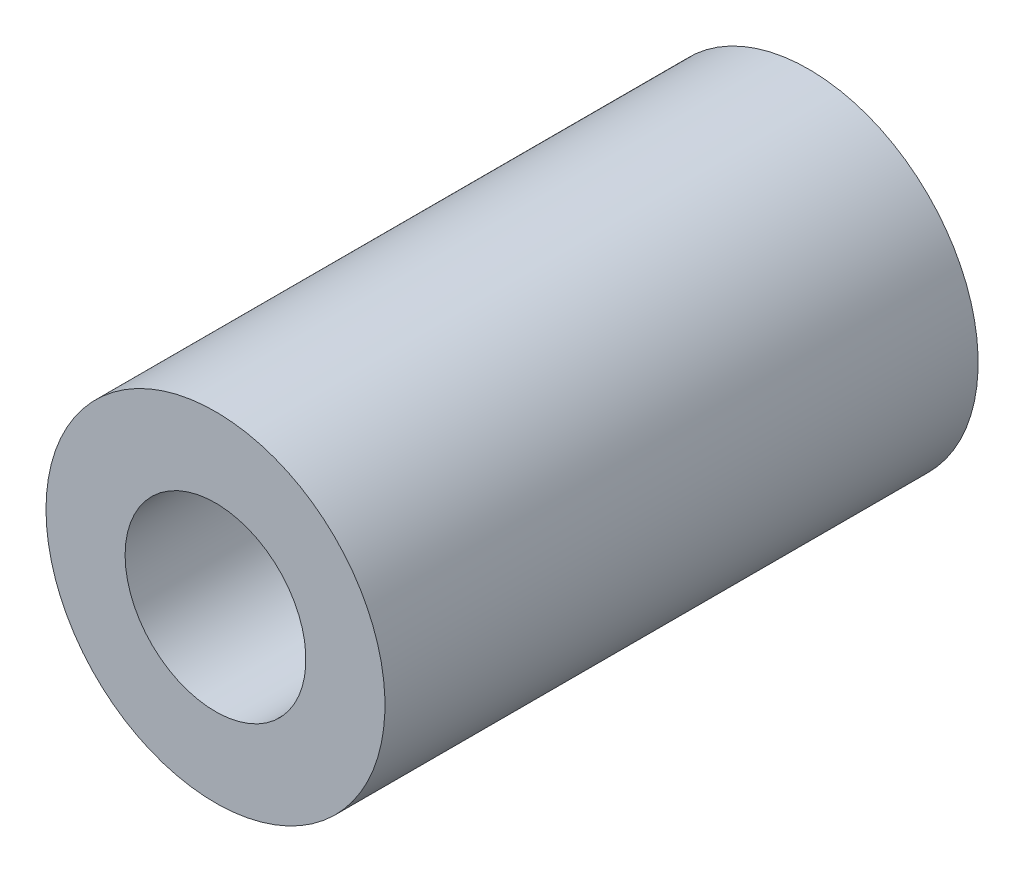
ISO-10303-21;
HEADER;
FILE_DESCRIPTION(('STEP AP214'),'2;1');
FILE_NAME('part.step','',(''),(''),'','','');
FILE_SCHEMA(('AUTOMOTIVE_DESIGN { 1 0 10303 214 1 1 1 1 }'));
ENDSEC;
DATA;
#1=APPLICATION_CONTEXT('core data for automotive mechanical design processes');
#2=APPLICATION_PROTOCOL_DEFINITION('international standard','automotive_design',2000,#1);
#3=PRODUCT_CONTEXT('',#1,'mechanical');
#4=PRODUCT('Part','Part','',(#3));
#5=PRODUCT_RELATED_PRODUCT_CATEGORY('part','',(#4));
#6=PRODUCT_DEFINITION_FORMATION('','',#4);
#7=PRODUCT_DEFINITION_CONTEXT('part definition',#1,'design');
#8=PRODUCT_DEFINITION('design','',#6,#7);
#9=PRODUCT_DEFINITION_SHAPE('','',#8);
#10=(LENGTH_UNIT() NAMED_UNIT(*) SI_UNIT(.MILLI.,.METRE.));
#11=(NAMED_UNIT(*) PLANE_ANGLE_UNIT() SI_UNIT($,.RADIAN.));
#12=(NAMED_UNIT(*) SI_UNIT($,.STERADIAN.) SOLID_ANGLE_UNIT());
#13=UNCERTAINTY_MEASURE_WITH_UNIT(LENGTH_MEASURE(1.E-05),#10,'distance_accuracy_value','');
#14=(GEOMETRIC_REPRESENTATION_CONTEXT(3) GLOBAL_UNCERTAINTY_ASSIGNED_CONTEXT((#13)) GLOBAL_UNIT_ASSIGNED_CONTEXT((#10,
#11,#12)) REPRESENTATION_CONTEXT('',''));
#15=CARTESIAN_POINT('',(0.,0.,0.));
#16=DIRECTION('',(0.,0.,1.));
#17=DIRECTION('',(1.,0.,0.));
#18=AXIS2_PLACEMENT_3D('',#15,#16,#17);
#19=CARTESIAN_POINT('',(0.,0.,10.5));
#20=DIRECTION('',(0.,0.,1.));
#21=DIRECTION('',(1.,0.,0.));
#22=AXIS2_PLACEMENT_3D('',#19,#20,#21);
#23=PLANE('',#22);
#24=CARTESIAN_POINT('',(0.,0.,10.5));
#25=DIRECTION('',(0.,0.,1.));
#26=DIRECTION('',(1.,0.,0.));
#27=AXIS2_PLACEMENT_3D('',#24,#25,#26);
#28=CIRCLE('',#27,3.);
#29=CARTESIAN_POINT('',(-3.,0.,10.5));
#30=VERTEX_POINT('',#29);
#31=EDGE_CURVE('E10',#30,#30,#28,.T.);
#32=ORIENTED_EDGE('',*,*,#31,.T.);
#33=EDGE_LOOP('',(#32));
#34=FACE_BOUND('',#33,.T.);
#35=CARTESIAN_POINT('',(0.,0.,10.5));
#36=DIRECTION('',(0.,0.,1.));
#37=DIRECTION('',(1.,0.,0.));
#38=AXIS2_PLACEMENT_3D('',#35,#36,#37);
#39=CIRCLE('',#38,1.6);
#40=CARTESIAN_POINT('',(-1.6,0.,10.5));
#41=VERTEX_POINT('',#40);
#42=EDGE_CURVE('E41',#41,#41,#39,.T.);
#43=ORIENTED_EDGE('',*,*,#42,.F.);
#44=EDGE_LOOP('',(#43));
#45=FACE_BOUND('',#44,.T.);
#46=ADVANCED_FACE('F30',(#34,#45),#23,.T.);
#47=CARTESIAN_POINT('',(0.,0.,0.));
#48=DIRECTION('',(0.,0.,1.));
#49=DIRECTION('',(1.,0.,0.));
#50=AXIS2_PLACEMENT_3D('',#47,#48,#49);
#51=PLANE('',#50);
#52=CARTESIAN_POINT('',(0.,0.,0.));
#53=DIRECTION('',(0.,0.,1.));
#54=DIRECTION('',(1.,0.,0.));
#55=AXIS2_PLACEMENT_3D('',#52,#53,#54);
#56=CIRCLE('',#55,3.);
#57=CARTESIAN_POINT('',(-3.,0.,0.));
#58=VERTEX_POINT('',#57);
#59=EDGE_CURVE('E34',#58,#58,#56,.T.);
#60=ORIENTED_EDGE('',*,*,#59,.F.);
#61=EDGE_LOOP('',(#60));
#62=FACE_BOUND('',#61,.T.);
#63=CARTESIAN_POINT('',(0.,0.,0.));
#64=DIRECTION('',(0.,0.,1.));
#65=DIRECTION('',(1.,0.,0.));
#66=AXIS2_PLACEMENT_3D('',#63,#64,#65);
#67=CIRCLE('',#66,1.6);
#68=CARTESIAN_POINT('',(-1.6,0.,0.));
#69=VERTEX_POINT('',#68);
#70=EDGE_CURVE('E43',#69,#69,#67,.T.);
#71=ORIENTED_EDGE('',*,*,#70,.T.);
#72=EDGE_LOOP('',(#71));
#73=FACE_BOUND('',#72,.T.);
#74=ADVANCED_FACE('F53',(#62,#73),#51,.F.);
#75=CARTESIAN_POINT('',(0.,0.,10.5));
#76=DIRECTION('',(0.,0.,-1.));
#77=DIRECTION('',(-1.,0.,0.));
#78=AXIS2_PLACEMENT_3D('',#75,#76,#77);
#79=CYLINDRICAL_SURFACE('',#78,3.);
#80=CARTESIAN_POINT('',(-3.,0.,10.5));
#81=CARTESIAN_POINT('',(-3.,0.,10.390625));
#82=CARTESIAN_POINT('',(-3.,0.,10.28125));
#83=CARTESIAN_POINT('',(-3.,0.,10.0625));
#84=CARTESIAN_POINT('',(-3.,0.,9.953125));
#85=CARTESIAN_POINT('',(-3.,0.,9.734375));
#86=CARTESIAN_POINT('',(-3.,0.,9.625));
#87=CARTESIAN_POINT('',(-3.,0.,9.40625));
#88=CARTESIAN_POINT('',(-3.,0.,9.296875));
#89=CARTESIAN_POINT('',(-3.,0.,9.078125));
#90=CARTESIAN_POINT('',(-3.,0.,8.96875));
#91=CARTESIAN_POINT('',(-3.,0.,8.75));
#92=CARTESIAN_POINT('',(-3.,0.,8.640625));
#93=CARTESIAN_POINT('',(-3.,0.,8.421875));
#94=CARTESIAN_POINT('',(-3.,0.,8.3125));
#95=CARTESIAN_POINT('',(-3.,0.,8.09375));
#96=CARTESIAN_POINT('',(-3.,0.,7.984375));
#97=CARTESIAN_POINT('',(-3.,0.,7.765625));
#98=CARTESIAN_POINT('',(-3.,0.,7.65625));
#99=CARTESIAN_POINT('',(-3.,0.,7.4375));
#100=CARTESIAN_POINT('',(-3.,0.,7.328125));
#101=CARTESIAN_POINT('',(-3.,0.,7.109375));
#102=CARTESIAN_POINT('',(-3.,0.,7.));
#103=CARTESIAN_POINT('',(-3.,0.,6.78125));
#104=CARTESIAN_POINT('',(-3.,0.,6.671875));
#105=CARTESIAN_POINT('',(-3.,0.,6.453125));
#106=CARTESIAN_POINT('',(-3.,0.,6.34375));
#107=CARTESIAN_POINT('',(-3.,0.,6.125));
#108=CARTESIAN_POINT('',(-3.,0.,6.015625));
#109=CARTESIAN_POINT('',(-3.,0.,5.796875));
#110=CARTESIAN_POINT('',(-3.,0.,5.6875));
#111=CARTESIAN_POINT('',(-3.,0.,5.46875));
#112=CARTESIAN_POINT('',(-3.,0.,5.359375));
#113=CARTESIAN_POINT('',(-3.,0.,5.140625));
#114=CARTESIAN_POINT('',(-3.,0.,5.03125));
#115=CARTESIAN_POINT('',(-3.,0.,4.8125));
#116=CARTESIAN_POINT('',(-3.,0.,4.703125));
#117=CARTESIAN_POINT('',(-3.,0.,4.484375));
#118=CARTESIAN_POINT('',(-3.,0.,4.375));
#119=CARTESIAN_POINT('',(-3.,0.,4.15625));
#120=CARTESIAN_POINT('',(-3.,0.,4.046875));
#121=CARTESIAN_POINT('',(-3.,0.,3.828125));
#122=CARTESIAN_POINT('',(-3.,0.,3.71875));
#123=CARTESIAN_POINT('',(-3.,0.,3.5));
#124=CARTESIAN_POINT('',(-3.,0.,3.390625));
#125=CARTESIAN_POINT('',(-3.,0.,3.171875));
#126=CARTESIAN_POINT('',(-3.,0.,3.0625));
#127=CARTESIAN_POINT('',(-3.,0.,2.84375));
#128=CARTESIAN_POINT('',(-3.,0.,2.734375));
#129=CARTESIAN_POINT('',(-3.,0.,2.515625));
#130=CARTESIAN_POINT('',(-3.,0.,2.40625));
#131=CARTESIAN_POINT('',(-3.,0.,2.1875));
#132=CARTESIAN_POINT('',(-3.,0.,2.078125));
#133=CARTESIAN_POINT('',(-3.,0.,1.859375));
#134=CARTESIAN_POINT('',(-3.,0.,1.75));
#135=CARTESIAN_POINT('',(-3.,0.,1.53125));
#136=CARTESIAN_POINT('',(-3.,0.,1.421875));
#137=CARTESIAN_POINT('',(-3.,0.,1.203125));
#138=CARTESIAN_POINT('',(-3.,0.,1.09375));
#139=CARTESIAN_POINT('',(-3.,0.,0.875000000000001));
#140=CARTESIAN_POINT('',(-3.,0.,0.765625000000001));
#141=CARTESIAN_POINT('',(-3.,0.,0.546875));
#142=CARTESIAN_POINT('',(-3.,0.,0.4375));
#143=CARTESIAN_POINT('',(-3.,0.,0.21875));
#144=CARTESIAN_POINT('',(-3.,0.,0.109375));
#145=CARTESIAN_POINT('',(-3.,0.,0.));
#146=B_SPLINE_CURVE_WITH_KNOTS('',3,(#80,#81,#82,#83,#84,#85,#86,#87,#88,#89,#90,#91,#92,#93,
#94,#95,#96,#97,#98,#99,#100,#101,#102,#103,#104,#105,#106,#107,#108,#109,#110,#111,#112,#113,
#114,#115,#116,#117,#118,#119,#120,#121,#122,#123,#124,#125,#126,#127,#128,#129,#130,#131,#132,
#133,#134,#135,#136,#137,#138,#139,#140,#141,#142,#143,#144,#145),.UNSPECIFIED.,.F.,.F.,(4,2,2,
2,2,2,2,2,2,2,2,2,2,2,2,2,2,2,2,2,2,2,2,2,2,2,2,2,2,2,2,2,4),(0.,0.328124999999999,
0.656249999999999,0.984374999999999,1.3125,1.640625,1.96875,2.296875,2.625,2.953125,3.28125,
3.609375,3.9375,4.265625,4.59375,4.921875,5.25,5.578125,5.90625,6.234375,6.5625,6.890625,
7.21875,7.546875,7.875,8.203125,8.53125,8.859375,9.1875,9.515625,9.84375,10.171875,10.5),.UNSPECIFIED.);
#147=EDGE_CURVE('BSEAM32',#30,#58,#146,.T.);
#148=ORIENTED_EDGE('',*,*,#31,.F.);
#149=ORIENTED_EDGE('',*,*,#59,.T.);
#150=ORIENTED_EDGE('',*,*,#147,.T.);
#151=ORIENTED_EDGE('',*,*,#147,.F.);
#152=EDGE_LOOP('',(#148,#150,#149,#151));
#153=FACE_BOUND('',#152,.T.);
#154=ADVANCED_FACE('F32',(#153),#79,.T.);
#155=CARTESIAN_POINT('',(0.,0.,10.5));
#156=DIRECTION('',(0.,0.,-1.));
#157=DIRECTION('',(-1.,0.,0.));
#158=AXIS2_PLACEMENT_3D('',#155,#156,#157);
#159=CYLINDRICAL_SURFACE('',#158,1.6);
#160=CARTESIAN_POINT('',(-1.6,0.,10.5));
#161=CARTESIAN_POINT('',(-1.6,0.,10.390625));
#162=CARTESIAN_POINT('',(-1.6,0.,10.28125));
#163=CARTESIAN_POINT('',(-1.6,0.,10.0625));
#164=CARTESIAN_POINT('',(-1.6,0.,9.953125));
#165=CARTESIAN_POINT('',(-1.6,0.,9.734375));
#166=CARTESIAN_POINT('',(-1.6,0.,9.625));
#167=CARTESIAN_POINT('',(-1.6,0.,9.40625));
#168=CARTESIAN_POINT('',(-1.6,0.,9.296875));
#169=CARTESIAN_POINT('',(-1.6,0.,9.078125));
#170=CARTESIAN_POINT('',(-1.6,0.,8.96875));
#171=CARTESIAN_POINT('',(-1.6,0.,8.75));
#172=CARTESIAN_POINT('',(-1.6,0.,8.640625));
#173=CARTESIAN_POINT('',(-1.6,0.,8.421875));
#174=CARTESIAN_POINT('',(-1.6,0.,8.3125));
#175=CARTESIAN_POINT('',(-1.6,0.,8.09375));
#176=CARTESIAN_POINT('',(-1.6,0.,7.984375));
#177=CARTESIAN_POINT('',(-1.6,0.,7.765625));
#178=CARTESIAN_POINT('',(-1.6,0.,7.65625));
#179=CARTESIAN_POINT('',(-1.6,0.,7.4375));
#180=CARTESIAN_POINT('',(-1.6,0.,7.328125));
#181=CARTESIAN_POINT('',(-1.6,0.,7.109375));
#182=CARTESIAN_POINT('',(-1.6,0.,7.));
#183=CARTESIAN_POINT('',(-1.6,0.,6.78125));
#184=CARTESIAN_POINT('',(-1.6,0.,6.671875));
#185=CARTESIAN_POINT('',(-1.6,0.,6.453125));
#186=CARTESIAN_POINT('',(-1.6,0.,6.34375));
#187=CARTESIAN_POINT('',(-1.6,0.,6.125));
#188=CARTESIAN_POINT('',(-1.6,0.,6.015625));
#189=CARTESIAN_POINT('',(-1.6,0.,5.796875));
#190=CARTESIAN_POINT('',(-1.6,0.,5.6875));
#191=CARTESIAN_POINT('',(-1.6,0.,5.46875));
#192=CARTESIAN_POINT('',(-1.6,0.,5.359375));
#193=CARTESIAN_POINT('',(-1.6,0.,5.140625));
#194=CARTESIAN_POINT('',(-1.6,0.,5.03125));
#195=CARTESIAN_POINT('',(-1.6,0.,4.8125));
#196=CARTESIAN_POINT('',(-1.6,0.,4.703125));
#197=CARTESIAN_POINT('',(-1.6,0.,4.484375));
#198=CARTESIAN_POINT('',(-1.6,0.,4.375));
#199=CARTESIAN_POINT('',(-1.6,0.,4.15625));
#200=CARTESIAN_POINT('',(-1.6,0.,4.046875));
#201=CARTESIAN_POINT('',(-1.6,0.,3.828125));
#202=CARTESIAN_POINT('',(-1.6,0.,3.71875));
#203=CARTESIAN_POINT('',(-1.6,0.,3.5));
#204=CARTESIAN_POINT('',(-1.6,0.,3.390625));
#205=CARTESIAN_POINT('',(-1.6,0.,3.171875));
#206=CARTESIAN_POINT('',(-1.6,0.,3.0625));
#207=CARTESIAN_POINT('',(-1.6,0.,2.84375));
#208=CARTESIAN_POINT('',(-1.6,0.,2.734375));
#209=CARTESIAN_POINT('',(-1.6,0.,2.515625));
#210=CARTESIAN_POINT('',(-1.6,0.,2.40625));
#211=CARTESIAN_POINT('',(-1.6,0.,2.1875));
#212=CARTESIAN_POINT('',(-1.6,0.,2.078125));
#213=CARTESIAN_POINT('',(-1.6,0.,1.859375));
#214=CARTESIAN_POINT('',(-1.6,0.,1.75));
#215=CARTESIAN_POINT('',(-1.6,0.,1.53125));
#216=CARTESIAN_POINT('',(-1.6,0.,1.421875));
#217=CARTESIAN_POINT('',(-1.6,0.,1.203125));
#218=CARTESIAN_POINT('',(-1.6,0.,1.09375));
#219=CARTESIAN_POINT('',(-1.6,0.,0.875000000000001));
#220=CARTESIAN_POINT('',(-1.6,0.,0.765625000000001));
#221=CARTESIAN_POINT('',(-1.6,0.,0.546875));
#222=CARTESIAN_POINT('',(-1.6,0.,0.4375));
#223=CARTESIAN_POINT('',(-1.6,0.,0.21875));
#224=CARTESIAN_POINT('',(-1.6,0.,0.109375));
#225=CARTESIAN_POINT('',(-1.6,0.,0.));
#226=B_SPLINE_CURVE_WITH_KNOTS('',3,(#160,#161,#162,#163,#164,#165,#166,#167,#168,#169,#170,
#171,#172,#173,#174,#175,#176,#177,#178,#179,#180,#181,#182,#183,#184,#185,#186,#187,#188,#189,
#190,#191,#192,#193,#194,#195,#196,#197,#198,#199,#200,#201,#202,#203,#204,#205,#206,#207,#208,
#209,#210,#211,#212,#213,#214,#215,#216,#217,#218,#219,#220,#221,#222,#223,#224,#225),
.UNSPECIFIED.,.F.,.F.,(4,2,2,2,2,2,2,2,2,2,2,2,2,2,2,2,2,2,2,2,2,2,2,2,2,2,2,2,2,2,2,2,4),(0.,
0.328125,0.656250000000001,0.984375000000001,1.3125,1.640625,1.96875,2.296875,2.625,2.953125,
3.28125,3.609375,3.9375,4.265625,4.59375,4.921875,5.25,5.578125,5.90625,6.234375,6.5625,
6.890625,7.21875,7.546875,7.875,8.203125,8.53125,8.859375,9.1875,9.515625,9.84375,10.171875,
10.5),.UNSPECIFIED.);
#227=EDGE_CURVE('BSEAM49',#41,#69,#226,.T.);
#228=ORIENTED_EDGE('',*,*,#42,.T.);
#229=ORIENTED_EDGE('',*,*,#70,.F.);
#230=ORIENTED_EDGE('',*,*,#227,.T.);
#231=ORIENTED_EDGE('',*,*,#227,.F.);
#232=EDGE_LOOP('',(#228,#230,#229,#231));
#233=FACE_BOUND('',#232,.T.);
#234=ADVANCED_FACE('F49',(#233),#159,.F.);
#235=CLOSED_SHELL('',(#46,#74,#154,#234));
#236=MANIFOLD_SOLID_BREP('B2',#235);
#237=ADVANCED_BREP_SHAPE_REPRESENTATION('',(#18,#236),#14);
#238=SHAPE_DEFINITION_REPRESENTATION(#9,#237);
ENDSEC;
END-ISO-10303-21;
